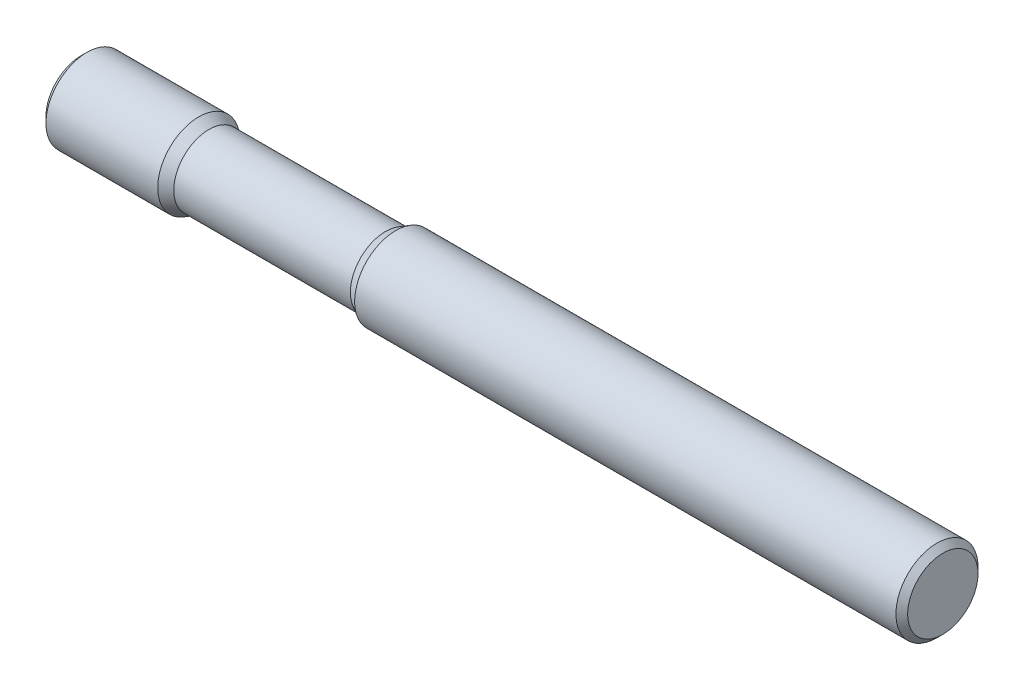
ISO-10303-21;
HEADER;
FILE_DESCRIPTION(('STEP AP214'),'2;1');
FILE_NAME('part.step','',(''),(''),'','','');
FILE_SCHEMA(('AUTOMOTIVE_DESIGN { 1 0 10303 214 1 1 1 1 }'));
ENDSEC;
DATA;
#1=APPLICATION_CONTEXT('core data for automotive mechanical design processes');
#2=APPLICATION_PROTOCOL_DEFINITION('international standard','automotive_design',2000,#1);
#3=PRODUCT_CONTEXT('',#1,'mechanical');
#4=PRODUCT('Part','Part','',(#3));
#5=PRODUCT_RELATED_PRODUCT_CATEGORY('part','',(#4));
#6=PRODUCT_DEFINITION_FORMATION('','',#4);
#7=PRODUCT_DEFINITION_CONTEXT('part definition',#1,'design');
#8=PRODUCT_DEFINITION('design','',#6,#7);
#9=PRODUCT_DEFINITION_SHAPE('','',#8);
#10=(LENGTH_UNIT() NAMED_UNIT(*) SI_UNIT(.MILLI.,.METRE.));
#11=(NAMED_UNIT(*) PLANE_ANGLE_UNIT() SI_UNIT($,.RADIAN.));
#12=(NAMED_UNIT(*) SI_UNIT($,.STERADIAN.) SOLID_ANGLE_UNIT());
#13=UNCERTAINTY_MEASURE_WITH_UNIT(LENGTH_MEASURE(1.E-05),#10,'distance_accuracy_value','');
#14=(GEOMETRIC_REPRESENTATION_CONTEXT(3) GLOBAL_UNCERTAINTY_ASSIGNED_CONTEXT((#13)) GLOBAL_UNIT_ASSIGNED_CONTEXT((#10,
#11,#12)) REPRESENTATION_CONTEXT('',''));
#15=CARTESIAN_POINT('',(0.,0.,0.));
#16=DIRECTION('',(0.,0.,1.));
#17=DIRECTION('',(1.,0.,0.));
#18=AXIS2_PLACEMENT_3D('',#15,#16,#17);
#19=CARTESIAN_POINT('',(0.,0.,0.));
#20=DIRECTION('',(-1.,0.,0.));
#21=DIRECTION('',(0.,0.,1.));
#22=AXIS2_PLACEMENT_3D('',#19,#20,#21);
#23=PLANE('',#22);
#24=CARTESIAN_POINT('',(0.,0.,0.));
#25=DIRECTION('',(1.,0.,0.));
#26=DIRECTION('',(0.,0.,-1.));
#27=AXIS2_PLACEMENT_3D('',#24,#25,#26);
#28=CIRCLE('',#27,12.8529775);
#29=CARTESIAN_POINT('',(0.,0.,-12.8529775));
#30=VERTEX_POINT('',#29);
#31=EDGE_CURVE('E10',#30,#30,#28,.T.);
#32=ORIENTED_EDGE('',*,*,#31,.F.);
#33=EDGE_LOOP('',(#32));
#34=FACE_BOUND('',#33,.T.);
#35=ADVANCED_FACE('F36',(#34),#23,.T.);
#36=CARTESIAN_POINT('',(2.14702249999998,0.,0.));
#37=DIRECTION('',(1.,0.,0.));
#38=DIRECTION('',(0.,0.,-1.));
#39=AXIS2_PLACEMENT_3D('',#36,#37,#38);
#40=CONICAL_SURFACE('',#39,15.,0.785398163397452);
#41=ORIENTED_EDGE('',*,*,#31,.T.);
#42=EDGE_LOOP('',(#41));
#43=FACE_BOUND('',#42,.T.);
#44=CARTESIAN_POINT('',(2.14702249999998,0.,0.));
#45=DIRECTION('',(1.,0.,0.));
#46=DIRECTION('',(0.,0.,-1.));
#47=AXIS2_PLACEMENT_3D('',#44,#45,#46);
#48=CIRCLE('',#47,15.);
#49=CARTESIAN_POINT('',(2.14702249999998,0.,-15.));
#50=VERTEX_POINT('',#49);
#51=EDGE_CURVE('E42',#50,#50,#48,.T.);
#52=ORIENTED_EDGE('',*,*,#51,.F.);
#53=EDGE_LOOP('',(#52));
#54=FACE_BOUND('',#53,.T.);
#55=ADVANCED_FACE('F84',(#43,#54),#40,.T.);
#56=CARTESIAN_POINT('',(315.,0.,0.));
#57=DIRECTION('',(1.,0.,0.));
#58=DIRECTION('',(0.,0.,-1.));
#59=AXIS2_PLACEMENT_3D('',#56,#57,#58);
#60=CYLINDRICAL_SURFACE('',#59,15.);
#61=ORIENTED_EDGE('',*,*,#51,.T.);
#62=EDGE_LOOP('',(#61));
#63=FACE_BOUND('',#62,.T.);
#64=CARTESIAN_POINT('',(43.,0.,0.));
#65=DIRECTION('',(1.,0.,0.));
#66=DIRECTION('',(0.,0.,-1.));
#67=AXIS2_PLACEMENT_3D('',#64,#65,#66);
#68=CIRCLE('',#67,15.);
#69=CARTESIAN_POINT('',(43.,0.,-15.));
#70=VERTEX_POINT('',#69);
#71=EDGE_CURVE('E46',#70,#70,#68,.T.);
#72=ORIENTED_EDGE('',*,*,#71,.F.);
#73=EDGE_LOOP('',(#72));
#74=FACE_BOUND('',#73,.T.);
#75=ADVANCED_FACE('F89',(#63,#74),#60,.T.);
#76=CARTESIAN_POINT('',(46.7187520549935,0.,0.));
#77=DIRECTION('',(-1.,0.,0.));
#78=DIRECTION('',(0.,0.,1.));
#79=AXIS2_PLACEMENT_3D('',#76,#77,#78);
#80=CONICAL_SURFACE('',#79,12.8529775,0.523598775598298);
#81=ORIENTED_EDGE('',*,*,#71,.T.);
#82=EDGE_LOOP('',(#81));
#83=FACE_BOUND('',#82,.T.);
#84=CARTESIAN_POINT('',(46.7187520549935,0.,0.));
#85=DIRECTION('',(1.,0.,0.));
#86=DIRECTION('',(0.,0.,-1.));
#87=AXIS2_PLACEMENT_3D('',#84,#85,#86);
#88=CIRCLE('',#87,12.8529775);
#89=CARTESIAN_POINT('',(46.7187520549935,0.,-12.8529775));
#90=VERTEX_POINT('',#89);
#91=EDGE_CURVE('E50',#90,#90,#88,.T.);
#92=ORIENTED_EDGE('',*,*,#91,.F.);
#93=EDGE_LOOP('',(#92));
#94=FACE_BOUND('',#93,.T.);
#95=ADVANCED_FACE('F93',(#83,#94),#80,.T.);
#96=CARTESIAN_POINT('',(315.,0.,0.));
#97=DIRECTION('',(1.,0.,0.));
#98=DIRECTION('',(0.,0.,-1.));
#99=AXIS2_PLACEMENT_3D('',#96,#97,#98);
#100=CYLINDRICAL_SURFACE('',#99,12.8529775);
#101=ORIENTED_EDGE('',*,*,#91,.T.);
#102=EDGE_LOOP('',(#101));
#103=FACE_BOUND('',#102,.T.);
#104=CARTESIAN_POINT('',(111.281247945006,0.,0.));
#105=DIRECTION('',(1.,0.,0.));
#106=DIRECTION('',(0.,0.,-1.));
#107=AXIS2_PLACEMENT_3D('',#104,#105,#106);
#108=CIRCLE('',#107,12.8529775);
#109=CARTESIAN_POINT('',(111.281247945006,0.,-12.8529775));
#110=VERTEX_POINT('',#109);
#111=EDGE_CURVE('E55',#110,#110,#108,.T.);
#112=ORIENTED_EDGE('',*,*,#111,.F.);
#113=EDGE_LOOP('',(#112));
#114=FACE_BOUND('',#113,.T.);
#115=ADVANCED_FACE('F99',(#103,#114),#100,.T.);
#116=CARTESIAN_POINT('',(115.,0.,0.));
#117=DIRECTION('',(1.,0.,0.));
#118=DIRECTION('',(0.,0.,-1.));
#119=AXIS2_PLACEMENT_3D('',#116,#117,#118);
#120=CONICAL_SURFACE('',#119,15.,0.523598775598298);
#121=ORIENTED_EDGE('',*,*,#111,.T.);
#122=EDGE_LOOP('',(#121));
#123=FACE_BOUND('',#122,.T.);
#124=CARTESIAN_POINT('',(115.,0.,0.));
#125=DIRECTION('',(1.,0.,0.));
#126=DIRECTION('',(0.,0.,-1.));
#127=AXIS2_PLACEMENT_3D('',#124,#125,#126);
#128=CIRCLE('',#127,15.);
#129=CARTESIAN_POINT('',(115.,0.,-15.));
#130=VERTEX_POINT('',#129);
#131=EDGE_CURVE('E58',#130,#130,#128,.T.);
#132=ORIENTED_EDGE('',*,*,#131,.F.);
#133=EDGE_LOOP('',(#132));
#134=FACE_BOUND('',#133,.T.);
#135=ADVANCED_FACE('F80',(#123,#134),#120,.T.);
#136=CARTESIAN_POINT('',(315.,0.,0.));
#137=DIRECTION('',(1.,0.,0.));
#138=DIRECTION('',(0.,0.,-1.));
#139=AXIS2_PLACEMENT_3D('',#136,#137,#138);
#140=CYLINDRICAL_SURFACE('',#139,15.);
#141=ORIENTED_EDGE('',*,*,#131,.T.);
#142=EDGE_LOOP('',(#141));
#143=FACE_BOUND('',#142,.T.);
#144=CARTESIAN_POINT('',(312.8529775,0.,0.));
#145=DIRECTION('',(1.,0.,0.));
#146=DIRECTION('',(0.,0.,-1.));
#147=AXIS2_PLACEMENT_3D('',#144,#145,#146);
#148=CIRCLE('',#147,15.);
#149=CARTESIAN_POINT('',(312.8529775,0.,-15.));
#150=VERTEX_POINT('',#149);
#151=EDGE_CURVE('E61',#150,#150,#148,.T.);
#152=ORIENTED_EDGE('',*,*,#151,.F.);
#153=EDGE_LOOP('',(#152));
#154=FACE_BOUND('',#153,.T.);
#155=ADVANCED_FACE('F72',(#143,#154),#140,.T.);
#156=CARTESIAN_POINT('',(315.,0.,0.));
#157=DIRECTION('',(-1.,0.,0.));
#158=DIRECTION('',(0.,0.,1.));
#159=AXIS2_PLACEMENT_3D('',#156,#157,#158);
#160=CONICAL_SURFACE('',#159,12.8529775,0.785398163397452);
#161=ORIENTED_EDGE('',*,*,#151,.T.);
#162=EDGE_LOOP('',(#161));
#163=FACE_BOUND('',#162,.T.);
#164=CARTESIAN_POINT('',(315.,0.,0.));
#165=DIRECTION('',(1.,0.,0.));
#166=DIRECTION('',(0.,0.,-1.));
#167=AXIS2_PLACEMENT_3D('',#164,#165,#166);
#168=CIRCLE('',#167,12.8529775);
#169=CARTESIAN_POINT('',(315.,0.,-12.8529775));
#170=VERTEX_POINT('',#169);
#171=EDGE_CURVE('E64',#170,#170,#168,.T.);
#172=ORIENTED_EDGE('',*,*,#171,.F.);
#173=EDGE_LOOP('',(#172));
#174=FACE_BOUND('',#173,.T.);
#175=ADVANCED_FACE('F70',(#163,#174),#160,.T.);
#176=CARTESIAN_POINT('',(315.,12.8529775,0.));
#177=DIRECTION('',(1.,0.,0.));
#178=DIRECTION('',(0.,0.,-1.));
#179=AXIS2_PLACEMENT_3D('',#176,#177,#178);
#180=PLANE('',#179);
#181=ORIENTED_EDGE('',*,*,#171,.T.);
#182=EDGE_LOOP('',(#181));
#183=FACE_BOUND('',#182,.T.);
#184=ADVANCED_FACE('F68',(#183),#180,.T.);
#185=CLOSED_SHELL('',(#35,#55,#75,#95,#115,#135,#155,#175,#184));
#186=MANIFOLD_SOLID_BREP('B2',#185);
#187=ADVANCED_BREP_SHAPE_REPRESENTATION('',(#18,#186),#14);
#188=SHAPE_DEFINITION_REPRESENTATION(#9,#187);
ENDSEC;
END-ISO-10303-21;
